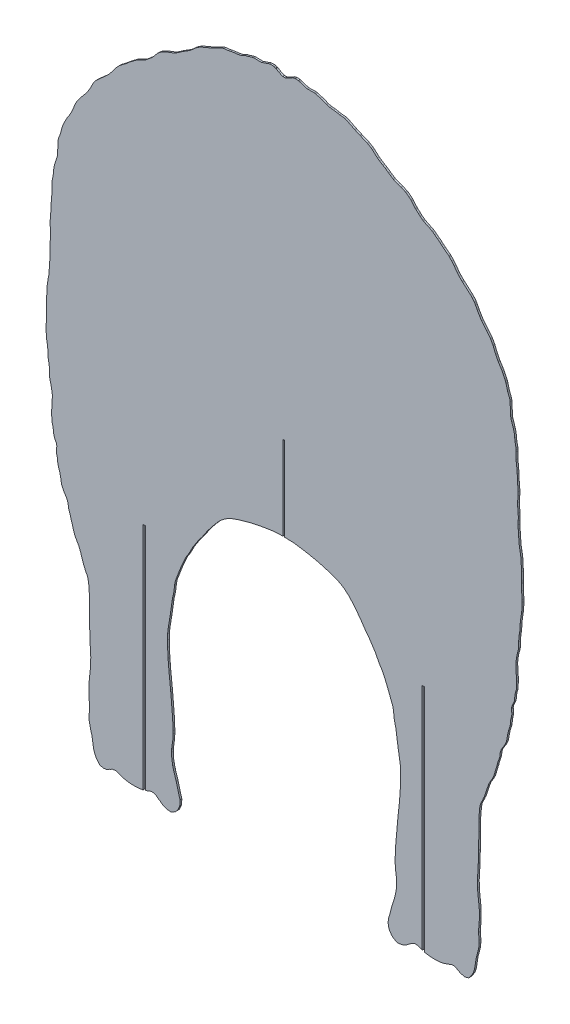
from build123d import *

# Parameters (mm, degrees)
EXTRUDE_1_DEPTH = 2


with BuildPart() as part:
    # Model → Extrude 1 (new body)
    with BuildSketch(Plane.XY):
        Polygon((-5202.6954, 1099.0275), (-5202.6613, 1090.2528), (-5202.722, 1088.5068), (-5202.7725, 1087.6386), (-5202.8295, 1086.497), (-5202.8038, 1080.4098), (-5203.304, 1071.0133), (-5203.3499, 1068.7169), (-5203.1594, 1065.0392), (-5202.8968, 1060.7317), (-5202.8394, 1059.8406), (-5202.7721, 1059.4981), (-5202.7048, 1059.1557), (-5202.5778, 1058.2051), (-5201.8625, 1054.0213), (-5201.2064, 1048.4236), (-5200.9608, 1043.9221), (-5200.9158, 1041.1125), (-5200.7299, 1040.1642), (-5199.9985, 1036.1432), (-5199.3775, 1030.2484), (-5199.3633, 1030.0172), (-5199.349, 1029.7859), (-5199.3491, 1029.0652), (-5199.3344, 1025.183), (-5199.2947, 1023.4181), (-5199.0479, 1021.8089), (-5197.7156, 1016.6927), (-5197.0541, 1013.0945), (-5196.4353, 1008.7228), (-5196.4522, 1005.7185), (-5196.8237, 996.7969), (-5197.1856, 993.2269), (-5197.1784, 990.8832), (-5196.8452, 982.4718), (-5196.8103, 982.3772), (-5196.7753, 982.2826), (-5196.119, 979.9115), (-5195.7389, 978.5799), (-5195.3097, 975.8839), (-5194.6318, 970.3298), (-5193.9113, 968.4614), (-5191.9519, 964.4352), (-5191.7373, 963.2824), (-5191.3429, 962.0163), (-5191.7068, 959.2917), (-5191.9226, 955.297), (-5191.8522, 954.9043), (-5191.7817, 954.5116), (-5190.6999, 950.7785), (-5190.4943, 948.1776), (-5190.3791, 946.3684), (-5190.189, 945.3608), (-5190.1329, 944.9966), (-5190.0769, 944.6323), (-5189.5729, 942.8308), (-5188.2397, 938.8125), (-5187.4042, 935.0848), (-5186.3434, 928.91), (-5185.9612, 927.2029), (-5184.4657, 923.8747), (-5184.075, 922.8846), (-5180.9575, 917.9985), (-5180.7146, 917.6124), (-5180.4718, 917.2262), (-5180.4459, 917.1883), (-5180.4202, 917.1505), (-5180.4155, 917.1354), (-5180.4063, 917.1123), (-5180.397, 917.0892), (-5178.7982, 912.5182), (-5178.5048, 908.7762), (-5177.4256, 905.5194), (-5176.5963, 903.3575), (-5175.7757, 900.3268), (-5175.3259, 898.3794), (-5174.6636, 896.4902), (-5173.0345, 890.7728), (-5171.51, 886.143), (-5169.4597, 882.2175), (-5167.7263, 879.3978), (-5167.4474, 878.9154), (-5167.1686, 878.4328), (-5166.0937, 875.8771), (-5165.4074, 874.0993), (-5164.9625, 872.8122), (-5162.8269, 866.4299), (-5161.3383, 861.5808), (-5160.3752, 859.9468), (-5159.6819, 858.0322), (-5157.4411, 853.7716), (-5156.864, 851.5293), (-5156.0519, 847.5389), (-5155.5784, 840.7879), (-5155.2749, 837.9112), (-5155.2221, 837.131), (-5155.3495, 834.1116), (-5155.3406, 824.707), (-5154.9852, 808.5478), (-5154.9796, 808.436), (-5154.9777, 808.4044), (-5154.9758, 808.3728), (-5154.9719, 808.2165), (-5154.6212, 793.8742), (-5153.9423, 781.7596), (-5153.7074, 777.5233), (-5153.8593, 770.6618), (-5153.8638, 769.0992), (-5154.1451, 766.2424), (-5155.78, 750.9589), (-5155.8274, 748.5695), (-5155.813, 742.1856), (-5155.6458, 737.217), (-5155.3478, 733.8855), (-5155.2457, 732.8574), (-5155.0552, 731.6394), (-5155.1755, 727.7783), (-5155.0831, 726.7011), (-5155.4994, 721.844), (-5155.4168, 717.852), (-5155.3995, 715.2605), (-5153.2953, 705.7724), (-5153.1444, 705.2882), (-5152.9936, 704.8039), (-5152.4826, 703.406), (-5150.5491, 690.9375), (-5149.4514, 687.4006), (-5147.4421, 683.3005), (-5147.3192, 683.1079), (-5147.1438, 682.9483), (-5146.9684, 682.7888), (-5144.0571, 679.0772), (-5143.7053, 678.8127), (-5143.3536, 678.5483), (-5142.1622, 678.5129), (-5140.9709, 678.4774), (-5140.0018, 678.1411), (-5139.0327, 677.8049), (-5137.4784, 678.3115), (-5136.8331, 678.3803), (-5136.1879, 678.4493), (-5133.1083, 680.1442), (-5131.9337, 680.5439), (-5130.1296, 681.7739), (-5127.9844, 682.1023), (-5127.6564, 682.2944), (-5127.3284, 682.4867), (-5126.6455, 682.4519), (-5125.9627, 682.4172), (-5125.1232, 682.3525), (-5122.8449, 681.4699), (-5116.2452, 679.1328), (-5113.3743, 678.6247), (-5109.0183, 678.0993), (-5104.8963, 678.0749), (-5101.2264, 678.2614), (-5096.9241, 678.7651), (-5095.729, 678.9841), (-5095.7111, 678.9887), (-5095.7111, 934.2953), (-5095.4611, 934.2953), (-5093.4611, 934.2953), (-5093.2111, 934.2953), (-5093.2111, 679.5849), (-5093.1267, 679.6047), (-5091.9054, 680.1276), (-5088.0388, 681.7271), (-5086.8471, 682.013), (-5084.105, 682.1573), (-5083.5109, 682.0266), (-5082.9168, 681.8957), (-5080.9629, 680.8281), (-5078.8604, 678.9016), (-5078.8162, 678.9692), (-5078.772, 679.0367), (-5076.4213, 677.5468), (-5075.4188, 676.5524), (-5074.6463, 676.0161), (-5072.4133, 675.0185), (-5071.9331, 674.7204), (-5071.4528, 674.4224), (-5068.3278, 673.654), (-5067.5283, 673.3813), (-5064.4964, 673.304), (-5063.8679, 673.5256), (-5063.2395, 673.747), (-5061.3798, 675.1721), (-5059.8366, 675.8855), (-5057.3812, 678.5643), (-5056.7214, 679.6286), (-5056.5191, 680.4282), (-5055.6295, 682.297), (-5054.9537, 683.715), (-5054.6406, 689.6416), (-5054.6367, 689.9714), (-5054.7415, 690.4467), (-5056.4092, 696.1143), (-5058.7814, 705.5661), (-5058.8091, 705.643), (-5058.8368, 705.7198), (-5061.3606, 713.4025), (-5061.9202, 715.7479), (-5062.7064, 718.5022), (-5063.084, 721.0147), (-5063.7592, 724.2583), (-5063.9633, 730.9787), (-5064.0633, 733.3053), (-5063.8925, 734.5938), (-5062.5761, 744.039), (-5062.4101, 749.3352), (-5062.4069, 752.3161), (-5062.6228, 759.9057), (-5063.0546, 766.9058), (-5064.7495, 786.9555), (-5064.8992, 788.524), (-5065.0633, 790.3146), (-5066.9088, 807.7543), (-5067.4115, 813.884), (-5067.8513, 818.4278), (-5067.9194, 819.8093), (-5068.387, 829.4878), (-5068.3911, 836.7295), (-5068.4461, 842.4897), (-5067.7922, 848.131), (-5067.7898, 848.1542), (-5067.7874, 848.1775), (-5067.7687, 848.2898), (-5065.7103, 860.8678), (-5064.3615, 869.9947), (-5063.4254, 876.9441), (-5063.0011, 879.5567), (-5062.3021, 882.4), (-5061.4442, 886.4664), (-5060.6844, 893.0699), (-5060.5956, 893.9961), (-5060.5634, 894.1227), (-5060.5313, 894.2491), (-5059.7145, 898.1553), (-5059.0864, 899.9397), (-5058.962, 900.2528), (-5058.8376, 900.5658), (-5058.2587, 901.969), (-5054.9058, 910.9272), (-5051.497, 919.1446), (-5050.2281, 921.8449), (-5048.167, 926.3814), (-5045.7388, 930.0707), (-5045.1654, 931.0162), (-5043.5745, 933.9931), (-5040.2687, 940.3531), (-5035.7192, 947.2965), (-5033.5709, 950.5819), (-5031.7586, 952.8146), (-5030.5583, 954.3714), (-5027.3518, 958.8523), (-5027.21, 959.0665), (-5027.0682, 959.2809), (-5026.9401, 959.4217), (-5025.1249, 962.3045), (-5023.9854, 964.0729), (-5021.7281, 966.8559), (-5020.1921, 969.0414), (-5016.4483, 973.5843), (-5015.2499, 975.0765), (-5013.1365, 977.3758), (-5011.3665, 979.3941), (-5010.9033, 979.9366), (-5009.9137, 980.8534), (-5005.4434, 984.4811), (-5004.6682, 984.9928), (-5001.7788, 986.8583), (-4998.0692, 988.6616), (-4997.4453, 988.9515), (-4996.8214, 989.2413), (-4989.069, 991.9322), (-4988.091, 992.2569), (-4987.256, 992.4718), (-4986.421, 992.6867), (-4977.1057, 995.316), (-4969.195, 997.0088), (-4968.6661, 997.1231), (-4968.1375, 997.2374), (-4963.2979, 998.155), (-4961.0531, 998.5993), (-4960.8129, 998.6296), (-4951.7425, 999.9855), (-4949.61, 1000.1376), (-4944.8473, 1000.5338), (-4940.4611, 1000.5564), (-4940.4611, 1093.6418), (-4938.4611, 1093.6418), (-4938.4611, 1000.5414), (-4929.0118, 1000.2191), (-4928.0068, 1000.1334), (-4927.0017, 1000.0476), (-4917.3661, 998.6314), (-4917.0518, 998.5912), (-4914.8036, 998.1426), (-4909.9403, 997.2215), (-4908.5605, 996.9237), (-4901.0555, 995.3148), (-4891.7802, 992.7018), (-4890.1712, 992.2857), (-4889.2486, 991.975), (-4881.4832, 989.32), (-4877.3622, 987.2958), (-4876.3005, 986.8226), (-4872.6542, 984.4324), (-4872.451, 984.296), (-4872.2477, 984.1598), (-4872.0983, 984.0218), (-4871.949, 983.884), (-4867.0999, 979.802), (-4866.8335, 979.4981), (-4866.5671, 979.1944), (-4864.8482, 977.19), (-4862.8944, 975.0598), (-4861.4952, 973.3164), (-4857.9316, 968.9934), (-4856.4099, 966.8185), (-4854.1273, 964.0057), (-4852.916, 962.11), (-4851.2769, 959.4903), (-4851.1787, 959.3839), (-4850.9587, 959.0514), (-4847.6622, 954.458), (-4846.3833, 952.7939), (-4844.5884, 950.5804), (-4842.3912, 947.2152), (-4837.9391, 940.4322), (-4834.6139, 934.0521), (-4832.9069, 930.8635), (-4832.2498, 929.7693), (-4829.9681, 926.3189), (-4827.921, 921.8161), (-4826.7684, 919.3771), (-4823.3662, 911.2057), (-4819.7588, 901.6056), (-4819.2579, 900.3867), (-4819.1575, 900.1383), (-4819.0572, 899.89), (-4818.413, 898.0543), (-4817.6482, 894.3298), (-4817.5605, 893.9819), (-4817.4094, 892.3543), (-4816.9723, 888.3692), (-4816.7769, 886.7096), (-4815.9309, 882.6775), (-4815.1305, 879.332), (-4814.7364, 876.9293), (-4813.8366, 870.2795), (-4812.1928, 859.1339), (-4810.482, 848.7718), (-4810.3412, 847.935), (-4810.302, 847.5554), (-4809.727, 842.6872), (-4809.7962, 836.8834), (-4809.786, 828.9548), (-4810.1534, 821.3894), (-4810.2472, 819.2882), (-4810.8243, 812.8227), (-4811.0833, 809.1893), (-4812.2191, 798.5748), (-4813.008, 791.162), (-4815.0799, 767.2858), (-4815.5393, 759.8237), (-4815.7617, 752.4594), (-4815.7554, 749.7688), (-4815.5853, 744.1539), (-4814.1558, 733.6004), (-4814.1313, 733.4191), (-4814.1441, 733.0771), (-4814.3704, 724.6057), (-4815.0423, 721.2351), (-4815.2257, 719.6508), (-4816.0154, 717.03), (-4816.2175, 715.6777), (-4816.7387, 713.6272), (-4818.9255, 706.9362), (-4819.6244, 704.9809), (-4821.9199, 695.6003), (-4822.955, 692.3139), (-4823.3551, 690.285), (-4823.5292, 688.1691), (-4823.5377, 686.6945), (-4823.1473, 683.6755), (-4822.7586, 682.5433), (-4822.5069, 681.4824), (-4820.8359, 678.9912), (-4820.226, 677.9311), (-4818.1917, 675.7983), (-4816.6343, 675.0896), (-4815.0059, 673.7424), (-4813.781, 673.3898), (-4811.2436, 673.344), (-4810.2442, 673.6357), (-4806.8604, 674.2902), (-4805.0705, 675.3774), (-4802.5789, 676.6401), (-4802.143, 677.0119), (-4801.8483, 677.3271), (-4799.2142, 679.2065), (-4798.1901, 680.0669), (-4797.6116, 680.4707), (-4797.0331, 680.8743), (-4794.7575, 681.965), (-4794.2679, 682.0551), (-4793.7783, 682.1453), (-4790.887, 681.9056), (-4790.4952, 681.8159), (-4790.1034, 681.7263), (-4786.1959, 680.0918), (-4785.8285, 679.9748), (-4785.7111, 679.9375), (-4785.7111, 934.2953), (-4785.4611, 934.2953), (-4783.4611, 934.2953), (-4783.2111, 934.2953), (-4783.2111, 679.1421), (-4783.1671, 679.1281), (-4782.8548, 679.0683), (-4782.7376, 679.069), (-4782.6203, 679.0697), (-4777.6592, 678.3399), (-4773.5696, 678.0676), (-4769.3945, 678.1076), (-4764.9843, 678.5476), (-4762.2557, 679.0578), (-4758.9929, 680.1176), (-4756.1631, 681.1357), (-4752.9693, 682.3903), (-4751.9332, 682.528), (-4750.6917, 682.5009), (-4750.0297, 682.1201), (-4748.6306, 681.8828), (-4746.684, 680.7819), (-4745.9604, 680.5158), (-4742.7314, 678.724), (-4740.3545, 678.3547), (-4738.7493, 677.7153), (-4735.3283, 678.7171), (-4734.8573, 678.7563), (-4734.3864, 678.7954), (-4733.9733, 679.1235), (-4730.7924, 683.1917), (-4730.6945, 683.5412), (-4728.9125, 686.5385), (-4727.7004, 690.5074), (-4725.5785, 703.594), (-4725.4233, 704.0153), (-4725.2681, 704.4366), (-4723.9169, 709.7834), (-4723.0822, 713.049), (-4723.037, 713.4035), (-4722.966, 714.0703), (-4722.7033, 717.6585), (-4722.6384, 720.8841), (-4723.1289, 727.3759), (-4722.9994, 728.7846), (-4723.0092, 732.465), (-4722.9203, 733.1074), (-4722.7566, 734.6644), (-4722.4749, 738.0383), (-4722.3359, 742.0349), (-4722.3278, 748.3286), (-4722.3821, 750.785), (-4722.8673, 755.7751), (-4724.2868, 768.7885), (-4724.2963, 770.6419), (-4724.4696, 777.1401), (-4724.2258, 781.5145), (-4723.5514, 793.6723), (-4723.5198, 794.7882), (-4723.2529, 806.5016), (-4723.2492, 806.5965), (-4723.2456, 806.6915), (-4723.24, 806.7481), (-4723.2344, 806.8049), (-4723.2093, 807.3633), (-4722.811, 825.0754), (-4722.8187, 833.9035), (-4722.9403, 836.8752), (-4722.8723, 837.6803), (-4722.2763, 844.5877), (-4721.9786, 848.748), (-4721.8596, 849.2395), (-4721.1259, 852.4067), (-4719.9884, 855.2287), (-4718.4292, 858.0101), (-4717.7593, 860.0223), (-4716.6936, 861.9866), (-4715.2581, 866.7219), (-4713.1996, 872.7103), (-4712.5807, 874.4686), (-4711.3427, 877.7738), (-4711.3049, 877.8651), (-4711.267, 877.9563), (-4711.2214, 878.0345), (-4711.1759, 878.1127), (-4708.1428, 883.1634), (-4706.6845, 885.983), (-4705.2879, 890.3176), (-4703.2799, 897.1166), (-4702.7252, 898.7571), (-4702.2051, 900.9188), (-4701.5542, 903.3888), (-4700.7691, 905.4183), (-4699.6224, 908.9383), (-4699.3101, 912.7568), (-4698.2972, 915.9619), (-4698.1599, 916.3014), (-4698.0226, 916.6407), (-4697.4577, 917.5128), (-4696.1778, 919.6491), (-4694.218, 922.6712), (-4692.277, 927.0606), (-4691.8341, 928.9808), (-4690.7719, 935.0184), (-4689.9043, 938.8235), (-4688.3107, 943.7525), (-4688.0664, 944.6705), (-4688.0203, 944.923), (-4687.9211, 945.447), (-4687.8659, 946.294), (-4687.4362, 950.8751), (-4687.0392, 952.0624), (-4686.3438, 955.7312), (-4686.2863, 957.812), (-4686.7116, 961.716), (-4686.4224, 962.8934), (-4686.1708, 964.5421), (-4684.1772, 968.5993), (-4683.5048, 970.3371), (-4682.8531, 976.1028), (-4682.5304, 978.2178), (-4682.072, 979.8141), (-4681.3311, 982.2506), (-4681.0439, 989.6561), (-4680.9132, 990.9825), (-4680.9627, 993.415), (-4681.3265, 996.5099), (-4681.7286, 1005.6533), (-4681.7591, 1007.9551), (-4681.1013, 1013.1407), (-4680.4231, 1016.843), (-4679.0476, 1021.8546), (-4678.8826, 1022.9438), (-4678.8699, 1024.0168), (-4678.7792, 1029.5137), (-4678.7774, 1029.6841), (-4678.7735, 1029.7434), (-4678.1662, 1036.1206), (-4677.5728, 1039.68), (-4677.2586, 1041.3083), (-4677.2489, 1043.3573), (-4676.964, 1048.2626), (-4676.2813, 1054.2578), (-4675.5877, 1058.2654), (-4675.4504, 1059.3078), (-4675.3467, 1059.8104), (-4675.2841, 1060.6291), (-4675.0459, 1064.7119), (-4674.8051, 1069.5183), (-4674.8637, 1072.2677), (-4675.369, 1080.0578), (-4675.3502, 1087.0722), (-4675.3996, 1088.0815), (-4675.4356, 1088.5976), (-4675.4854, 1090.0038), (-4675.4524, 1098.8334), (-4675.5952, 1101.6706), (-4676.1317, 1111.3095), (-4676.1747, 1111.8085), (-4676.2519, 1112.2665), (-4677.0981, 1117.7736), (-4677.8741, 1121.7863), (-4678.4254, 1128.3175), (-4678.6588, 1130.3949), (-4678.786, 1134.0282), (-4679.1392, 1137.9076), (-4679.2705, 1141.8537), (-4679.1524, 1145.8654), (-4679.0785, 1149.9325), (-4679.2369, 1153.2965), (-4679.7006, 1158.8661), (-4679.8449, 1162.9772), (-4679.4274, 1169.696), (-4679.3568, 1173.8752), (-4679.6567, 1179.2629), (-4680.0359, 1182.8544), (-4680.0709, 1185.9181), (-4680.2575, 1190.5478), (-4680.5968, 1193.7292), (-4680.6509, 1195.829), (-4681.3209, 1201.0588), (-4681.6332, 1203.258), (-4681.5874, 1210.9411), (-4681.3896, 1213.1027), (-4681.6708, 1215.0021), (-4682.7176, 1220.2568), (-4683.0456, 1223.6093), (-4683.4631, 1227.6862), (-4684.4707, 1231.8461), (-4684.9295, 1233.1095), (-4686.2411, 1237.2997), (-4687.0859, 1239.685), (-4687.2541, 1240.2985), (-4687.4048, 1241.1181), (-4687.5438, 1243.1457), (-4687.844, 1248.8708), (-4688.2318, 1255.9108), (-4688.3958, 1257.6051), (-4688.7376, 1258.9338), (-4690.8207, 1264.2111), (-4691.2858, 1265.9474), (-4692.5866, 1270.9936), (-4692.8722, 1271.727), (-4693.2307, 1272.9919), (-4693.5435, 1273.7763), (-4694.228, 1275.1366), (-4695.8191, 1278.5612), (-4696.8858, 1280.7338), (-4698.2678, 1283.0461), (-4701.1496, 1287.5834), (-4701.3155, 1287.8581), (-4701.4815, 1288.1327), (-4701.5819, 1288.2738), (-4701.5928, 1288.2919), (-4704.1834, 1293.3512), (-4706.9927, 1300.3056), (-4707.3655, 1301.1393), (-4709.7332, 1305.3866), (-4709.9367, 1305.651), (-4710.1401, 1305.9154), (-4714.1512, 1311.1398), (-4717.7616, 1315.4765), (-4719.7556, 1317.8344), (-4721.9125, 1321.1015), (-4724.5739, 1325.7392), (-4726.6243, 1329.7394), (-4727.5912, 1331.5404), (-4727.8228, 1331.8644), (-4728.0545, 1332.1884), (-4730.2169, 1334.8942), (-4732.2662, 1336.9245), (-4740.8029, 1344.5126), (-4741.4374, 1345.0102), (-4741.606, 1345.1879), (-4744.5899, 1348.2165), (-4746.7636, 1350.7631), (-4750.2651, 1355.4137), (-4752.9488, 1358.7365), (-4755.6066, 1361.5851), (-4755.9989, 1361.9906), (-4756.3912, 1362.3962), (-4762.042, 1366.7253), (-4764.2758, 1368.4377), (-4766.0657, 1370.1213), (-4768.7731, 1372.2519), (-4772.0177, 1374.6715), (-4774.0959, 1376.2585), (-4775.26, 1377.0273), (-4777.6242, 1378.2953), (-4780.2241, 1379.424), (-4784.0158, 1381.3466), (-4784.4598, 1381.5983), (-4785.2153, 1382.144), (-4787.9396, 1384.174), (-4789.8029, 1386.0124), (-4792.6892, 1388.4328), (-4793.1126, 1388.8649), (-4793.5361, 1389.297), (-4797.6314, 1394.1515), (-4798.5891, 1395.2358), (-4800.4035, 1396.7638), (-4803.5637, 1399.0746), (-4804.0737, 1399.341), (-4804.5836, 1399.6071), (-4808.8562, 1401.5517), (-4809.4572, 1401.8803), (-4812.3618, 1402.9526), (-4817.2618, 1404.7521), (-4817.5811, 1404.9172), (-4818.4096, 1405.4601), (-4820.9592, 1407.092), (-4822.9748, 1408.465), (-4826.653, 1411.1073), (-4829.8441, 1412.9797), (-4833.229, 1415.1342), (-4835.4211, 1416.6713), (-4841.1232, 1421.7421), (-4842.5247, 1422.8268), (-4845.5067, 1424.6386), (-4846.8631, 1425.4162), (-4854.006, 1428.3764), (-4854.6637, 1428.6474), (-4854.8972, 1428.7663), (-4855.1307, 1428.8852), (-4860.3703, 1431.2016), (-4860.6268, 1431.3407), (-4860.8812, 1431.4779), (-4869.28, 1435.6806), (-4871.2933, 1436.4582), (-4872.4089, 1436.7936), (-4877.5499, 1437.2245), (-4879.7001, 1437.7633), (-4884.087, 1438.4545), (-4887.0768, 1438.7109), (-4888.5522, 1438.9272), (-4891.6454, 1439.693), (-4891.9944, 1439.8368), (-4892.3433, 1439.9804), (-4896.9208, 1442.0436), (-4899.0384, 1442.5111), (-4903.5279, 1443.9577), (-4903.9438, 1444.0627), (-4904.3598, 1444.1676), (-4905.1553, 1444.2516), (-4905.9509, 1444.3354), (-4913.352, 1444.1757), (-4913.7095, 1444.2148), (-4914.0669, 1444.2536), (-4921.2609, 1446.6928), (-4922.1273, 1446.9975), (-4922.9936, 1447.3022), (-4923.0556, 1447.3041), (-4926.582, 1447.4811), (-4927.2527, 1447.3322), (-4927.9233, 1447.183), (-4928.604, 1447.0851), (-4929.2848, 1446.987), (-4929.9344, 1446.4982), (-4932.9279, 1444.6462), (-4933.5814, 1444.2987), (-4937.5824, 1442.5551), (-4938.1226, 1442.527), (-4938.6627, 1442.4987), (-4940.5606, 1442.5653), (-4944.7817, 1444.3363), (-4945.0344, 1444.4674), (-4947.9047, 1446.3195), (-4948.8022, 1446.4377), (-4950.3026, 1447.2245), (-4951.0337, 1447.339), (-4951.7648, 1447.4535), (-4954.9739, 1447.3014), (-4955.085, 1447.3092), (-4955.1497, 1447.3014), (-4955.4769, 1447.1774), (-4964.0305, 1444.2389), (-4964.6296, 1444.1718), (-4972.2883, 1444.3295), (-4972.9949, 1444.2629), (-4973.7015, 1444.196), (-4974.5545, 1443.985), (-4978.906, 1442.5866), (-4981.3523, 1442.0153), (-4985.666, 1440.037), (-4985.9861, 1439.892), (-4986.395, 1439.7382), (-4989.7715, 1438.9233), (-4991.6539, 1438.6401), (-4994.0804, 1438.4408), (-4998.7292, 1437.7126), (-5000.6919, 1437.2277), (-5005.6483, 1436.7951), (-5006.9003, 1436.4311), (-5008.8728, 1435.6852), (-5017.7805, 1431.2311), (-5017.7877, 1431.2277), (-5017.795, 1431.2243), (-5017.7962, 1431.224), (-5017.7983, 1431.2233), (-5017.8524, 1431.2004), (-5017.9056, 1431.1777), (-5023.101, 1428.8559), (-5023.593, 1428.6029), (-5024.3906, 1428.2716), (-5031.209, 1425.467), (-5032.403, 1424.7787), (-5035.7377, 1422.7624), (-5037.1921, 1421.6154), (-5042.7029, 1416.6928), (-5044.8181, 1415.2099), (-5048.186, 1413.0673), (-5051.3888, 1411.1911), (-5055.0471, 1408.5588), (-5057.0538, 1407.1906), (-5059.0036, 1405.943), (-5060.3276, 1405.07), (-5060.867, 1404.7941), (-5066.8922, 1402.5544), (-5068.6394, 1401.9008), (-5068.9468, 1401.7294), (-5069.2542, 1401.5578), (-5074.3283, 1399.1894), (-5075.2612, 1398.7109), (-5077.6126, 1396.8732), (-5079.4555, 1395.3488), (-5080.4197, 1394.2624), (-5085.141, 1388.6838), (-5085.8756, 1387.9401), (-5088.8209, 1385.6374), (-5090.3839, 1384.1596), (-5093.4443, 1381.7712), (-5093.6976, 1381.5812), (-5093.7957, 1381.5258), (-5097.4597, 1379.6571), (-5100.5673, 1378.2648), (-5102.7819, 1377.1183), (-5103.8788, 1376.4023), (-5105.7959, 1374.9198), (-5109.1671, 1372.4084), (-5111.9812, 1370.2165), (-5113.7562, 1368.5241), (-5116.0377, 1366.7926), (-5121.8872, 1362.3095), (-5122.4907, 1361.6767), (-5125.1765, 1358.7856), (-5128.4077, 1354.769), (-5131.7645, 1350.2858), (-5133.7687, 1347.9948), (-5136.5341, 1345.2121), (-5136.5597, 1345.1845), (-5136.5854, 1345.1567), (-5136.6594, 1345.0986), (-5136.7335, 1345.0404), (-5146.002, 1336.8075), (-5147.7941, 1335.1249), (-5149.564, 1333.0116), (-5150.3338, 1332.0068), (-5151.07, 1330.6447), (-5153.738, 1325.4369), (-5156.4024, 1320.7965), (-5158.2899, 1317.9736), (-5160.3154, 1315.571), (-5163.7955, 1311.4052), (-5168.1322, 1305.767), (-5168.3209, 1305.5204), (-5168.5095, 1305.2738), (-5170.7643, 1301.2069), (-5171.2079, 1300.2167), (-5174.0465, 1293.2018), (-5176.5776, 1288.2536), (-5176.5922, 1288.2326), (-5176.6067, 1288.2116), (-5176.7846, 1287.9589), (-5176.9624, 1287.706), (-5177.6599, 1286.5529), (-5179.6741, 1283.4406), (-5181.1501, 1280.9743), (-5182.3057, 1278.6154), (-5183.95, 1275.079), (-5184.6851, 1273.6349), (-5184.8285, 1273.2646), (-5184.9719, 1272.8944), (-5185.0764, 1272.5546), (-5185.181, 1272.2148), (-5185.5819, 1271.2043), (-5186.8209, 1266.1083), (-5187.3747, 1264.0768), (-5189.4087, 1259.0204), (-5189.7778, 1257.641), (-5189.9503, 1255.9081), (-5190.3655, 1247.8136), (-5190.6185, 1242.4125), (-5190.7314, 1241.0929), (-5190.791, 1240.7528), (-5190.8506, 1240.4125), (-5190.9266, 1240.143), (-5191.0028, 1239.8737), (-5192.0899, 1236.7565), (-5193.3384, 1232.8881), (-5193.4697, 1232.5273), (-5193.601, 1232.1662), (-5194.6802, 1227.7895), (-5195.1155, 1223.4296), (-5195.4398, 1220.2455), (-5196.4523, 1215.174), (-5196.793, 1213.0339), (-5196.5411, 1210.5329), (-5196.5043, 1203.3586), (-5196.8632, 1200.9115), (-5197.4813, 1196.0956), (-5197.5217, 1194.0231), (-5197.8847, 1190.706), (-5198.0764, 1185.9989), (-5198.1563, 1182.4916), (-5198.5172, 1179.1579), (-5198.8084, 1173.8647), (-5198.6751, 1168.4316), (-5198.3294, 1162.955), (-5198.4576, 1158.612), (-5198.8978, 1153.6034), (-5199.0864, 1149.6635), (-5198.9938, 1145.1532), (-5198.9014, 1141.8561), (-5199.018, 1138.1654), (-5199.3372, 1134.7814), (-5199.4706, 1130.6689), (-5199.7973, 1127.6523), (-5200.2977, 1121.6979), (-5201.0329, 1117.9377), (-5201.96, 1111.9843), (-5202.0161, 1111.6437), (-5202.0288, 1111.4801), (-5202.0416, 1111.3166), (-5202.5673, 1101.6918), align=None)
    extrude(amount=EXTRUDE_1_DEPTH)


solid = part.part
